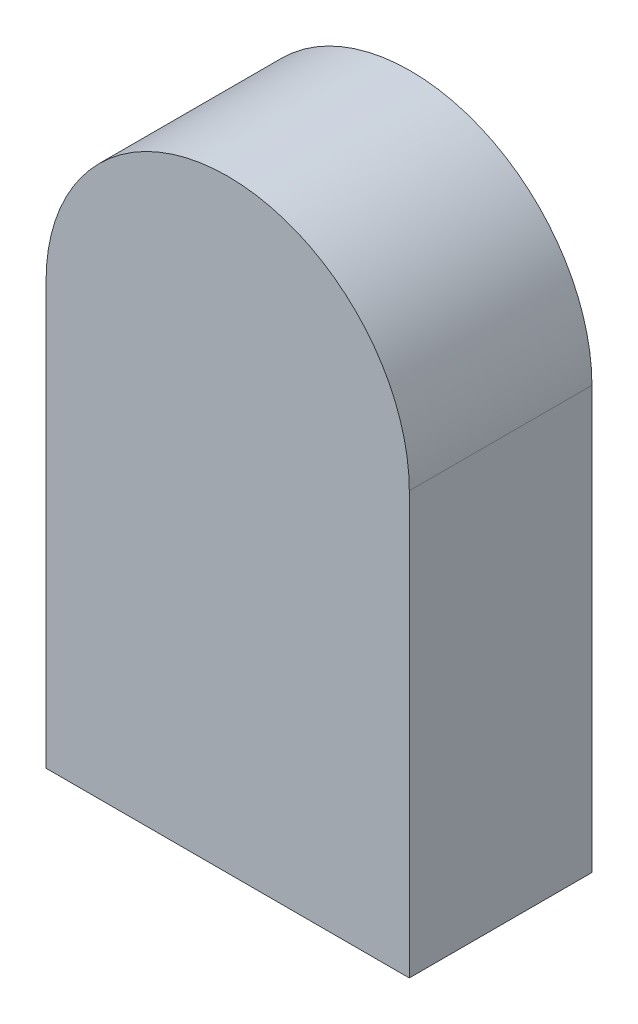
ISO-10303-21;
HEADER;
FILE_DESCRIPTION(('STEP AP214'),'2;1');
FILE_NAME('part.step','',(''),(''),'','','');
FILE_SCHEMA(('AUTOMOTIVE_DESIGN { 1 0 10303 214 1 1 1 1 }'));
ENDSEC;
DATA;
#1=APPLICATION_CONTEXT('core data for automotive mechanical design processes');
#2=APPLICATION_PROTOCOL_DEFINITION('international standard','automotive_design',2000,#1);
#3=PRODUCT_CONTEXT('',#1,'mechanical');
#4=PRODUCT('Part','Part','',(#3));
#5=PRODUCT_RELATED_PRODUCT_CATEGORY('part','',(#4));
#6=PRODUCT_DEFINITION_FORMATION('','',#4);
#7=PRODUCT_DEFINITION_CONTEXT('part definition',#1,'design');
#8=PRODUCT_DEFINITION('design','',#6,#7);
#9=PRODUCT_DEFINITION_SHAPE('','',#8);
#10=(LENGTH_UNIT() NAMED_UNIT(*) SI_UNIT(.MILLI.,.METRE.));
#11=(NAMED_UNIT(*) PLANE_ANGLE_UNIT() SI_UNIT($,.RADIAN.));
#12=(NAMED_UNIT(*) SI_UNIT($,.STERADIAN.) SOLID_ANGLE_UNIT());
#13=UNCERTAINTY_MEASURE_WITH_UNIT(LENGTH_MEASURE(1.E-05),#10,'distance_accuracy_value','');
#14=(GEOMETRIC_REPRESENTATION_CONTEXT(3) GLOBAL_UNCERTAINTY_ASSIGNED_CONTEXT((#13)) GLOBAL_UNIT_ASSIGNED_CONTEXT((#10,
#11,#12)) REPRESENTATION_CONTEXT('',''));
#15=CARTESIAN_POINT('',(0.,0.,0.));
#16=DIRECTION('',(0.,0.,1.));
#17=DIRECTION('',(1.,0.,0.));
#18=AXIS2_PLACEMENT_3D('',#15,#16,#17);
#19=CARTESIAN_POINT('',(26.7186482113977,62.0768593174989,26.8697379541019));
#20=DIRECTION('',(0.,0.,-1.));
#21=DIRECTION('',(-1.,0.,0.));
#22=AXIS2_PLACEMENT_3D('',#19,#20,#21);
#23=CYLINDRICAL_SURFACE('',#22,26.7186482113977);
#24=CARTESIAN_POINT('',(26.7186482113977,62.0768593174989,0.));
#25=DIRECTION('',(0.,0.,1.));
#26=DIRECTION('',(1.,0.,0.));
#27=AXIS2_PLACEMENT_3D('',#24,#25,#26);
#28=CIRCLE('',#27,26.7186482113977);
#29=CARTESIAN_POINT('',(53.4372964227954,62.0768593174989,0.));
#30=VERTEX_POINT('',#29);
#31=CARTESIAN_POINT('',(0.,62.0768593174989,0.));
#32=VERTEX_POINT('',#31);
#33=EDGE_CURVE('E70',#30,#32,#28,.T.);
#34=ORIENTED_EDGE('',*,*,#33,.T.);
#35=DIRECTION('',(0.,0.,-1.));
#36=VECTOR('',#35,1.);
#37=CARTESIAN_POINT('',(0.,62.0768593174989,26.8697379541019));
#38=LINE('',#37,#36);
#39=CARTESIAN_POINT('',(0.,62.0768593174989,26.8697379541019));
#40=VERTEX_POINT('',#39);
#41=EDGE_CURVE('E11',#40,#32,#38,.T.);
#42=ORIENTED_EDGE('',*,*,#41,.F.);
#43=CARTESIAN_POINT('',(26.7186482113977,62.0768593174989,26.8697379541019));
#44=DIRECTION('',(0.,0.,1.));
#45=DIRECTION('',(1.,0.,0.));
#46=AXIS2_PLACEMENT_3D('',#43,#44,#45);
#47=CIRCLE('',#46,26.7186482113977);
#48=CARTESIAN_POINT('',(53.4372964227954,62.0768593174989,26.8697379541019));
#49=VERTEX_POINT('',#48);
#50=EDGE_CURVE('E88',#49,#40,#47,.T.);
#51=ORIENTED_EDGE('',*,*,#50,.F.);
#52=DIRECTION('',(0.,0.,-1.));
#53=VECTOR('',#52,1.);
#54=CARTESIAN_POINT('',(53.4372964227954,62.0768593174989,26.8697379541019));
#55=LINE('',#54,#53);
#56=EDGE_CURVE('E82',#49,#30,#55,.T.);
#57=ORIENTED_EDGE('',*,*,#56,.T.);
#58=EDGE_LOOP('',(#34,#42,#51,#57));
#59=FACE_BOUND('',#58,.T.);
#60=ADVANCED_FACE('F26',(#59),#23,.T.);
#61=CARTESIAN_POINT('',(0.,62.0768593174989,26.8697379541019));
#62=DIRECTION('',(1.,0.,0.));
#63=DIRECTION('',(0.,0.,-1.));
#64=AXIS2_PLACEMENT_3D('',#61,#62,#63);
#65=PLANE('',#64);
#66=DIRECTION('',(0.,-1.,0.));
#67=VECTOR('',#66,1.);
#68=CARTESIAN_POINT('',(0.,62.0768593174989,0.));
#69=LINE('',#68,#67);
#70=CARTESIAN_POINT('',(0.,0.,0.));
#71=VERTEX_POINT('',#70);
#72=EDGE_CURVE('E66',#32,#71,#69,.T.);
#73=ORIENTED_EDGE('',*,*,#72,.T.);
#74=DIRECTION('',(0.,0.,-1.));
#75=VECTOR('',#74,1.);
#76=CARTESIAN_POINT('',(0.,0.,26.8697379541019));
#77=LINE('',#76,#75);
#78=CARTESIAN_POINT('',(0.,0.,26.8697379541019));
#79=VERTEX_POINT('',#78);
#80=EDGE_CURVE('E33',#79,#71,#77,.T.);
#81=ORIENTED_EDGE('',*,*,#80,.F.);
#82=DIRECTION('',(0.,-1.,0.));
#83=VECTOR('',#82,1.);
#84=CARTESIAN_POINT('',(0.,62.0768593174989,26.8697379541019));
#85=LINE('',#84,#83);
#86=EDGE_CURVE('E78',#40,#79,#85,.T.);
#87=ORIENTED_EDGE('',*,*,#86,.F.);
#88=ORIENTED_EDGE('',*,*,#41,.T.);
#89=EDGE_LOOP('',(#73,#81,#87,#88));
#90=FACE_BOUND('',#89,.T.);
#91=ADVANCED_FACE('F77',(#90),#65,.F.);
#92=CARTESIAN_POINT('',(0.,0.,26.8697379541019));
#93=DIRECTION('',(0.,1.,0.));
#94=DIRECTION('',(0.,0.,1.));
#95=AXIS2_PLACEMENT_3D('',#92,#93,#94);
#96=PLANE('',#95);
#97=DIRECTION('',(1.,0.,0.));
#98=VECTOR('',#97,1.);
#99=CARTESIAN_POINT('',(0.,0.,0.));
#100=LINE('',#99,#98);
#101=CARTESIAN_POINT('',(53.4372964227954,0.,0.));
#102=VERTEX_POINT('',#101);
#103=EDGE_CURVE('E71',#71,#102,#100,.T.);
#104=ORIENTED_EDGE('',*,*,#103,.T.);
#105=DIRECTION('',(0.,0.,-1.));
#106=VECTOR('',#105,1.);
#107=CARTESIAN_POINT('',(53.4372964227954,0.,26.8697379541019));
#108=LINE('',#107,#106);
#109=CARTESIAN_POINT('',(53.4372964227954,0.,26.8697379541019));
#110=VERTEX_POINT('',#109);
#111=EDGE_CURVE('E94',#110,#102,#108,.T.);
#112=ORIENTED_EDGE('',*,*,#111,.F.);
#113=DIRECTION('',(1.,0.,0.));
#114=VECTOR('',#113,1.);
#115=CARTESIAN_POINT('',(0.,0.,26.8697379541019));
#116=LINE('',#115,#114);
#117=EDGE_CURVE('E45',#79,#110,#116,.T.);
#118=ORIENTED_EDGE('',*,*,#117,.F.);
#119=ORIENTED_EDGE('',*,*,#80,.T.);
#120=EDGE_LOOP('',(#104,#112,#118,#119));
#121=FACE_BOUND('',#120,.T.);
#122=ADVANCED_FACE('F97',(#121),#96,.F.);
#123=CARTESIAN_POINT('',(53.4372964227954,0.,26.8697379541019));
#124=DIRECTION('',(-1.,0.,0.));
#125=DIRECTION('',(0.,0.,1.));
#126=AXIS2_PLACEMENT_3D('',#123,#124,#125);
#127=PLANE('',#126);
#128=DIRECTION('',(0.,1.,0.));
#129=VECTOR('',#128,1.);
#130=CARTESIAN_POINT('',(53.4372964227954,0.,0.));
#131=LINE('',#130,#129);
#132=EDGE_CURVE('E86',#102,#30,#131,.T.);
#133=ORIENTED_EDGE('',*,*,#132,.T.);
#134=ORIENTED_EDGE('',*,*,#56,.F.);
#135=DIRECTION('',(0.,1.,0.));
#136=VECTOR('',#135,1.);
#137=CARTESIAN_POINT('',(53.4372964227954,0.,26.8697379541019));
#138=LINE('',#137,#136);
#139=EDGE_CURVE('E40',#110,#49,#138,.T.);
#140=ORIENTED_EDGE('',*,*,#139,.F.);
#141=ORIENTED_EDGE('',*,*,#111,.T.);
#142=EDGE_LOOP('',(#133,#134,#140,#141));
#143=FACE_BOUND('',#142,.T.);
#144=ADVANCED_FACE('F99',(#143),#127,.F.);
#145=CARTESIAN_POINT('',(26.7186482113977,62.0768593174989,26.8697379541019));
#146=DIRECTION('',(0.,0.,1.));
#147=DIRECTION('',(1.,0.,0.));
#148=AXIS2_PLACEMENT_3D('',#145,#146,#147);
#149=PLANE('',#148);
#150=ORIENTED_EDGE('',*,*,#50,.T.);
#151=ORIENTED_EDGE('',*,*,#86,.T.);
#152=ORIENTED_EDGE('',*,*,#117,.T.);
#153=ORIENTED_EDGE('',*,*,#139,.T.);
#154=EDGE_LOOP('',(#150,#151,#152,#153));
#155=FACE_BOUND('',#154,.T.);
#156=ADVANCED_FACE('F100',(#155),#149,.T.);
#157=CARTESIAN_POINT('',(26.7186482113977,62.0768593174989,0.));
#158=DIRECTION('',(0.,0.,1.));
#159=DIRECTION('',(1.,0.,0.));
#160=AXIS2_PLACEMENT_3D('',#157,#158,#159);
#161=PLANE('',#160);
#162=ORIENTED_EDGE('',*,*,#33,.F.);
#163=ORIENTED_EDGE('',*,*,#132,.F.);
#164=ORIENTED_EDGE('',*,*,#103,.F.);
#165=ORIENTED_EDGE('',*,*,#72,.F.);
#166=EDGE_LOOP('',(#162,#163,#164,#165));
#167=FACE_BOUND('',#166,.T.);
#168=ADVANCED_FACE('F67',(#167),#161,.F.);
#169=CLOSED_SHELL('',(#60,#91,#122,#144,#156,#168));
#170=MANIFOLD_SOLID_BREP('B2',#169);
#171=ADVANCED_BREP_SHAPE_REPRESENTATION('',(#18,#170),#14);
#172=SHAPE_DEFINITION_REPRESENTATION(#9,#171);
ENDSEC;
END-ISO-10303-21;
